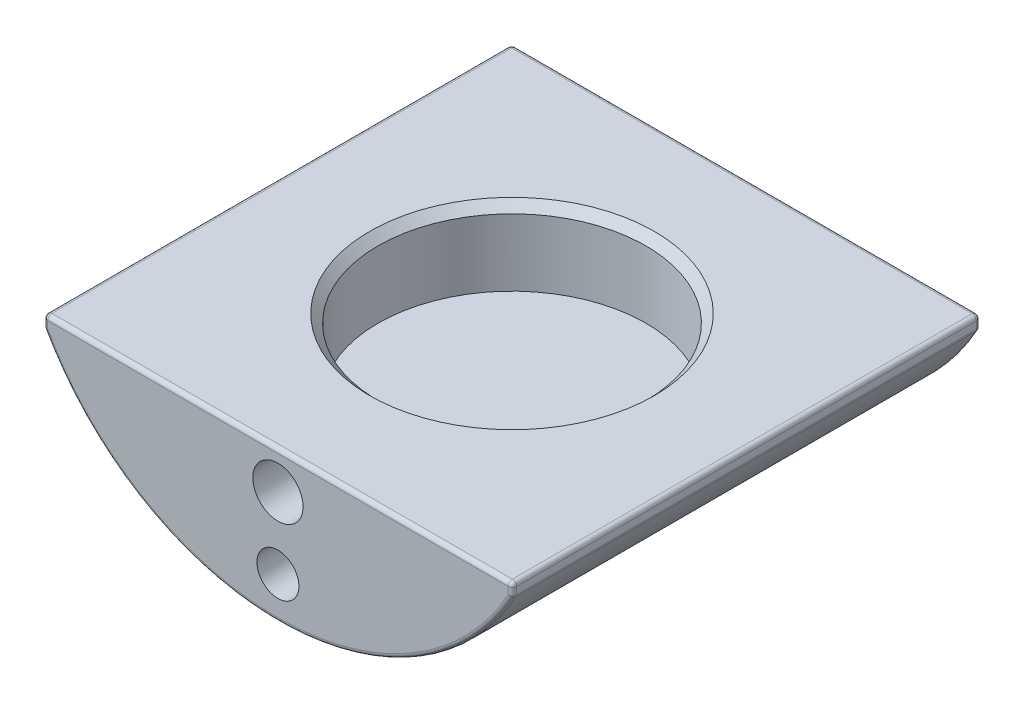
ISO-10303-21;
HEADER;
FILE_DESCRIPTION(('STEP AP214'),'2;1');
FILE_NAME('part.step','',(''),(''),'','','');
FILE_SCHEMA(('AUTOMOTIVE_DESIGN { 1 0 10303 214 1 1 1 1 }'));
ENDSEC;
DATA;
#1=APPLICATION_CONTEXT('core data for automotive mechanical design processes');
#2=APPLICATION_PROTOCOL_DEFINITION('international standard','automotive_design',2000,#1);
#3=PRODUCT_CONTEXT('',#1,'mechanical');
#4=PRODUCT('Part','Part','',(#3));
#5=PRODUCT_RELATED_PRODUCT_CATEGORY('part','',(#4));
#6=PRODUCT_DEFINITION_FORMATION('','',#4);
#7=PRODUCT_DEFINITION_CONTEXT('part definition',#1,'design');
#8=PRODUCT_DEFINITION('design','',#6,#7);
#9=PRODUCT_DEFINITION_SHAPE('','',#8);
#10=(LENGTH_UNIT() NAMED_UNIT(*) SI_UNIT(.MILLI.,.METRE.));
#11=(NAMED_UNIT(*) PLANE_ANGLE_UNIT() SI_UNIT($,.RADIAN.));
#12=(NAMED_UNIT(*) SI_UNIT($,.STERADIAN.) SOLID_ANGLE_UNIT());
#13=UNCERTAINTY_MEASURE_WITH_UNIT(LENGTH_MEASURE(1.E-05),#10,'distance_accuracy_value','');
#14=(GEOMETRIC_REPRESENTATION_CONTEXT(3) GLOBAL_UNCERTAINTY_ASSIGNED_CONTEXT((#13)) GLOBAL_UNIT_ASSIGNED_CONTEXT((#10,
#11,#12)) REPRESENTATION_CONTEXT('',''));
#15=CARTESIAN_POINT('',(0.,0.,0.));
#16=DIRECTION('',(0.,0.,1.));
#17=DIRECTION('',(1.,0.,0.));
#18=AXIS2_PLACEMENT_3D('',#15,#16,#17);
#19=CARTESIAN_POINT('',(0.,22.225,-44.3865));
#20=DIRECTION('',(0.,0.,1.));
#21=DIRECTION('',(1.,0.,0.));
#22=AXIS2_PLACEMENT_3D('',#19,#20,#21);
#23=PLANE('',#22);
#24=DIRECTION('',(0.,-1.,0.));
#25=VECTOR('',#24,1.);
#26=CARTESIAN_POINT('',(-43.65625,-0.79375,-44.3865));
#27=LINE('',#26,#25);
#28=CARTESIAN_POINT('',(-43.65625,-2.16263774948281,-44.3865));
#29=VERTEX_POINT('',#28);
#30=CARTESIAN_POINT('',(-43.65625,-0.79375,-44.3865));
#31=VERTEX_POINT('',#30);
#32=EDGE_CURVE('E197',#29,#31,#27,.F.);
#33=ORIENTED_EDGE('',*,*,#32,.T.);
#34=DIRECTION('',(1.,0.,0.));
#35=VECTOR('',#34,1.);
#36=CARTESIAN_POINT('',(0.,-0.793750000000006,-44.3865));
#37=LINE('',#36,#35);
#38=CARTESIAN_POINT('',(43.65625,-0.793750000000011,-44.3865));
#39=VERTEX_POINT('',#38);
#40=EDGE_CURVE('E199',#31,#39,#37,.T.);
#41=ORIENTED_EDGE('',*,*,#40,.T.);
#42=DIRECTION('',(0.,1.,0.));
#43=VECTOR('',#42,1.);
#44=CARTESIAN_POINT('',(43.65625,-2.16263774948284,-44.3865));
#45=LINE('',#44,#43);
#46=CARTESIAN_POINT('',(43.65625,-2.16263774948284,-44.3865));
#47=VERTEX_POINT('',#46);
#48=EDGE_CURVE('E195',#39,#47,#45,.F.);
#49=ORIENTED_EDGE('',*,*,#48,.T.);
#50=CARTESIAN_POINT('',(0.,22.225,-44.3865));
#51=DIRECTION('',(0.,0.,1.));
#52=DIRECTION('',(1.,0.,0.));
#53=AXIS2_PLACEMENT_3D('',#50,#51,#52);
#54=CIRCLE('',#53,50.00625);
#55=EDGE_CURVE('E193',#47,#29,#54,.F.);
#56=ORIENTED_EDGE('',*,*,#55,.T.);
#57=EDGE_LOOP('',(#33,#41,#49,#56));
#58=FACE_BOUND('',#57,.T.);
#59=CARTESIAN_POINT('',(0.,-7.14375,-44.3865));
#60=DIRECTION('',(0.,0.,1.));
#61=DIRECTION('',(1.,0.,0.));
#62=AXIS2_PLACEMENT_3D('',#59,#60,#61);
#63=CIRCLE('',#62,4.7625);
#64=CARTESIAN_POINT('',(4.7625,-7.14375,-44.3865));
#65=VERTEX_POINT('',#64);
#66=EDGE_CURVE('E300',#65,#65,#63,.T.);
#67=ORIENTED_EDGE('',*,*,#66,.T.);
#68=EDGE_LOOP('',(#67));
#69=FACE_BOUND('',#68,.T.);
#70=CARTESIAN_POINT('',(0.,-20.6248,-44.3865000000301));
#71=DIRECTION('',(0.,0.,1.));
#72=DIRECTION('',(1.,0.,0.));
#73=AXIS2_PLACEMENT_3D('',#70,#71,#72);
#74=CIRCLE('',#73,3.9751);
#75=CARTESIAN_POINT('',(3.9751,-20.6248,-44.3865000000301));
#76=VERTEX_POINT('',#75);
#77=EDGE_CURVE('E294',#76,#76,#74,.T.);
#78=ORIENTED_EDGE('',*,*,#77,.T.);
#79=EDGE_LOOP('',(#78));
#80=FACE_BOUND('',#79,.T.);
#81=ADVANCED_FACE('F31',(#58,#69,#80),#23,.F.);
#82=CARTESIAN_POINT('',(-44.45,0.,-44.3865));
#83=DIRECTION('',(-1.,0.,0.));
#84=DIRECTION('',(0.,-1.,0.));
#85=AXIS2_PLACEMENT_3D('',#82,#83,#84);
#86=PLANE('',#85);
#87=DIRECTION('',(0.,0.,1.));
#88=VECTOR('',#87,1.);
#89=CARTESIAN_POINT('',(-44.45,-0.793749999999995,-44.3865));
#90=LINE('',#89,#88);
#91=CARTESIAN_POINT('',(-44.45,-0.793749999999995,43.59275));
#92=VERTEX_POINT('',#91);
#93=CARTESIAN_POINT('',(-44.45,-0.793749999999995,-43.59275));
#94=VERTEX_POINT('',#93);
#95=EDGE_CURVE('E171',#92,#94,#90,.F.);
#96=ORIENTED_EDGE('',*,*,#95,.T.);
#97=DIRECTION('',(0.,-1.,0.));
#98=VECTOR('',#97,1.);
#99=CARTESIAN_POINT('',(-44.45,-2.16263774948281,-43.59275));
#100=LINE('',#99,#98);
#101=CARTESIAN_POINT('',(-44.45,-2.16263774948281,-43.59275));
#102=VERTEX_POINT('',#101);
#103=EDGE_CURVE('E207',#94,#102,#100,.T.);
#104=ORIENTED_EDGE('',*,*,#103,.T.);
#105=DIRECTION('',(0.,0.,1.));
#106=VECTOR('',#105,1.);
#107=CARTESIAN_POINT('',(-44.45,-2.16263774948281,-44.3865));
#108=LINE('',#107,#106);
#109=CARTESIAN_POINT('',(-44.45,-2.16263774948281,43.59275));
#110=VERTEX_POINT('',#109);
#111=EDGE_CURVE('E157',#102,#110,#108,.T.);
#112=ORIENTED_EDGE('',*,*,#111,.T.);
#113=DIRECTION('',(0.,-1.,0.));
#114=VECTOR('',#113,1.);
#115=CARTESIAN_POINT('',(-44.45,0.,43.59275));
#116=LINE('',#115,#114);
#117=EDGE_CURVE('E144',#110,#92,#116,.F.);
#118=ORIENTED_EDGE('',*,*,#117,.T.);
#119=EDGE_LOOP('',(#96,#104,#112,#118));
#120=FACE_BOUND('',#119,.T.);
#121=ADVANCED_FACE('F33',(#120),#86,.T.);
#122=CARTESIAN_POINT('',(-44.45,0.,-44.3865));
#123=DIRECTION('',(0.,-1.,0.));
#124=DIRECTION('',(1.,0.,0.));
#125=AXIS2_PLACEMENT_3D('',#122,#123,#124);
#126=PLANE('',#125);
#127=CARTESIAN_POINT('',(0.,0.,0.));
#128=DIRECTION('',(0.,-1.,0.));
#129=DIRECTION('',(1.,0.,0.));
#130=AXIS2_PLACEMENT_3D('',#127,#128,#129);
#131=CIRCLE('',#130,26.9875);
#132=CARTESIAN_POINT('',(26.9875,0.,0.));
#133=VERTEX_POINT('',#132);
#134=EDGE_CURVE('E11',#133,#133,#131,.T.);
#135=ORIENTED_EDGE('',*,*,#134,.T.);
#136=EDGE_LOOP('',(#135));
#137=FACE_BOUND('',#136,.T.);
#138=DIRECTION('',(0.,0.,1.));
#139=VECTOR('',#138,1.);
#140=CARTESIAN_POINT('',(43.65625,0.,-44.3865));
#141=LINE('',#140,#139);
#142=CARTESIAN_POINT('',(43.65625,0.,43.59275));
#143=VERTEX_POINT('',#142);
#144=CARTESIAN_POINT('',(43.65625,0.,-43.59275));
#145=VERTEX_POINT('',#144);
#146=EDGE_CURVE('E151',#143,#145,#141,.F.);
#147=ORIENTED_EDGE('',*,*,#146,.T.);
#148=DIRECTION('',(1.,0.,0.));
#149=VECTOR('',#148,1.);
#150=CARTESIAN_POINT('',(-44.45,0.,-43.59275));
#151=LINE('',#150,#149);
#152=CARTESIAN_POINT('',(-43.65625,0.,-43.59275));
#153=VERTEX_POINT('',#152);
#154=EDGE_CURVE('E202',#145,#153,#151,.F.);
#155=ORIENTED_EDGE('',*,*,#154,.T.);
#156=DIRECTION('',(0.,0.,1.));
#157=VECTOR('',#156,1.);
#158=CARTESIAN_POINT('',(-43.65625,0.,44.3865));
#159=LINE('',#158,#157);
#160=CARTESIAN_POINT('',(-43.65625,0.,43.59275));
#161=VERTEX_POINT('',#160);
#162=EDGE_CURVE('E154',#153,#161,#159,.T.);
#163=ORIENTED_EDGE('',*,*,#162,.T.);
#164=DIRECTION('',(1.,0.,0.));
#165=VECTOR('',#164,1.);
#166=CARTESIAN_POINT('',(43.65625,0.,43.59275));
#167=LINE('',#166,#165);
#168=EDGE_CURVE('E127',#161,#143,#167,.T.);
#169=ORIENTED_EDGE('',*,*,#168,.T.);
#170=EDGE_LOOP('',(#147,#155,#163,#169));
#171=FACE_BOUND('',#170,.T.);
#172=ADVANCED_FACE('F149',(#137,#171),#126,.F.);
#173=CARTESIAN_POINT('',(44.45,-2.3684442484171,-44.3865));
#174=DIRECTION('',(1.,0.,0.));
#175=DIRECTION('',(0.,1.,0.));
#176=AXIS2_PLACEMENT_3D('',#173,#174,#175);
#177=PLANE('',#176);
#178=DIRECTION('',(0.,0.,1.));
#179=VECTOR('',#178,1.);
#180=CARTESIAN_POINT('',(44.45,-2.16263774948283,-44.3865));
#181=LINE('',#180,#179);
#182=CARTESIAN_POINT('',(44.45,-2.16263774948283,43.59275));
#183=VERTEX_POINT('',#182);
#184=CARTESIAN_POINT('',(44.45,-2.16263774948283,-43.59275));
#185=VERTEX_POINT('',#184);
#186=EDGE_CURVE('E321',#183,#185,#181,.F.);
#187=ORIENTED_EDGE('',*,*,#186,.T.);
#188=DIRECTION('',(0.,1.,0.));
#189=VECTOR('',#188,1.);
#190=CARTESIAN_POINT('',(44.45,-0.793750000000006,-43.59275));
#191=LINE('',#190,#189);
#192=CARTESIAN_POINT('',(44.45,-0.793750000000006,-43.59275));
#193=VERTEX_POINT('',#192);
#194=EDGE_CURVE('E209',#185,#193,#191,.T.);
#195=ORIENTED_EDGE('',*,*,#194,.T.);
#196=DIRECTION('',(0.,0.,1.));
#197=VECTOR('',#196,1.);
#198=CARTESIAN_POINT('',(44.45,-0.793750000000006,44.3865));
#199=LINE('',#198,#197);
#200=CARTESIAN_POINT('',(44.45,-0.793750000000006,43.59275));
#201=VERTEX_POINT('',#200);
#202=EDGE_CURVE('E166',#193,#201,#199,.T.);
#203=ORIENTED_EDGE('',*,*,#202,.T.);
#204=DIRECTION('',(0.,1.,0.));
#205=VECTOR('',#204,1.);
#206=CARTESIAN_POINT('',(44.45,-2.3684442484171,43.59275));
#207=LINE('',#206,#205);
#208=EDGE_CURVE('E183',#201,#183,#207,.F.);
#209=ORIENTED_EDGE('',*,*,#208,.T.);
#210=EDGE_LOOP('',(#187,#195,#203,#209));
#211=FACE_BOUND('',#210,.T.);
#212=ADVANCED_FACE('F246',(#211),#177,.T.);
#213=CARTESIAN_POINT('',(0.,22.225,-44.3865));
#214=DIRECTION('',(0.,0.,1.));
#215=DIRECTION('',(1.,0.,0.));
#216=AXIS2_PLACEMENT_3D('',#213,#214,#215);
#217=CYLINDRICAL_SURFACE('',#216,50.8);
#218=DIRECTION('',(0.,0.,1.));
#219=VECTOR('',#218,1.);
#220=CARTESIAN_POINT('',(-44.3492063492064,-2.54974311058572,-44.3865));
#221=LINE('',#220,#219);
#222=CARTESIAN_POINT('',(-44.3492063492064,-2.54974311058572,43.59275));
#223=VERTEX_POINT('',#222);
#224=CARTESIAN_POINT('',(-44.3492063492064,-2.54974311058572,-43.59275));
#225=VERTEX_POINT('',#224);
#226=EDGE_CURVE('E162',#223,#225,#221,.F.);
#227=ORIENTED_EDGE('',*,*,#226,.T.);
#228=CARTESIAN_POINT('',(0.,22.225,-43.59275));
#229=DIRECTION('',(0.,0.,1.));
#230=DIRECTION('',(1.,0.,0.));
#231=AXIS2_PLACEMENT_3D('',#228,#229,#230);
#232=CIRCLE('',#231,50.8);
#233=CARTESIAN_POINT('',(44.3492063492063,-2.54974311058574,-43.59275));
#234=VERTEX_POINT('',#233);
#235=EDGE_CURVE('E46',#225,#234,#232,.T.);
#236=ORIENTED_EDGE('',*,*,#235,.T.);
#237=DIRECTION('',(0.,0.,1.));
#238=VECTOR('',#237,1.);
#239=CARTESIAN_POINT('',(44.3492063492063,-2.54974311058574,-44.3865));
#240=LINE('',#239,#238);
#241=CARTESIAN_POINT('',(44.3492063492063,-2.54974311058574,43.59275));
#242=VERTEX_POINT('',#241);
#243=EDGE_CURVE('E164',#234,#242,#240,.T.);
#244=ORIENTED_EDGE('',*,*,#243,.T.);
#245=CARTESIAN_POINT('',(0.,22.225,43.59275));
#246=DIRECTION('',(0.,0.,1.));
#247=DIRECTION('',(1.,0.,0.));
#248=AXIS2_PLACEMENT_3D('',#245,#246,#247);
#249=CIRCLE('',#248,50.8);
#250=EDGE_CURVE('E191',#242,#223,#249,.F.);
#251=ORIENTED_EDGE('',*,*,#250,.T.);
#252=EDGE_LOOP('',(#227,#236,#244,#251));
#253=FACE_BOUND('',#252,.T.);
#254=ADVANCED_FACE('F249',(#253),#217,.T.);
#255=CARTESIAN_POINT('',(0.,22.225,44.3865));
#256=DIRECTION('',(0.,0.,1.));
#257=DIRECTION('',(1.,0.,0.));
#258=AXIS2_PLACEMENT_3D('',#255,#256,#257);
#259=PLANE('',#258);
#260=DIRECTION('',(0.,1.,0.));
#261=VECTOR('',#260,1.);
#262=CARTESIAN_POINT('',(43.6562499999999,22.2250000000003,44.3865));
#263=LINE('',#262,#261);
#264=CARTESIAN_POINT('',(43.65625,-2.16263774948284,44.3865));
#265=VERTEX_POINT('',#264);
#266=CARTESIAN_POINT('',(43.65625,-0.793750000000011,44.3865));
#267=VERTEX_POINT('',#266);
#268=EDGE_CURVE('E176',#265,#267,#263,.T.);
#269=ORIENTED_EDGE('',*,*,#268,.T.);
#270=DIRECTION('',(1.,0.,0.));
#271=VECTOR('',#270,1.);
#272=CARTESIAN_POINT('',(-43.65625,-0.79375,44.3865));
#273=LINE('',#272,#271);
#274=CARTESIAN_POINT('',(-43.65625,-0.79375,44.3865));
#275=VERTEX_POINT('',#274);
#276=EDGE_CURVE('E129',#267,#275,#273,.F.);
#277=ORIENTED_EDGE('',*,*,#276,.T.);
#278=DIRECTION('',(0.,-1.,0.));
#279=VECTOR('',#278,1.);
#280=CARTESIAN_POINT('',(-43.6562499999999,22.2250000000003,44.3865));
#281=LINE('',#280,#279);
#282=CARTESIAN_POINT('',(-43.65625,-2.16263774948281,44.3865));
#283=VERTEX_POINT('',#282);
#284=EDGE_CURVE('E178',#275,#283,#281,.T.);
#285=ORIENTED_EDGE('',*,*,#284,.T.);
#286=CARTESIAN_POINT('',(0.,22.225,44.3865));
#287=DIRECTION('',(0.,0.,1.));
#288=DIRECTION('',(1.,0.,0.));
#289=AXIS2_PLACEMENT_3D('',#286,#287,#288);
#290=CIRCLE('',#289,50.00625);
#291=EDGE_CURVE('E156',#283,#265,#290,.T.);
#292=ORIENTED_EDGE('',*,*,#291,.T.);
#293=EDGE_LOOP('',(#269,#277,#285,#292));
#294=FACE_BOUND('',#293,.T.);
#295=CARTESIAN_POINT('',(0.,-20.6248,44.3865000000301));
#296=DIRECTION('',(0.,0.,1.));
#297=DIRECTION('',(1.,0.,0.));
#298=AXIS2_PLACEMENT_3D('',#295,#296,#297);
#299=CIRCLE('',#298,3.9751);
#300=CARTESIAN_POINT('',(3.9751,-20.6248,44.3865000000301));
#301=VERTEX_POINT('',#300);
#302=EDGE_CURVE('E306',#301,#301,#299,.T.);
#303=ORIENTED_EDGE('',*,*,#302,.F.);
#304=EDGE_LOOP('',(#303));
#305=FACE_BOUND('',#304,.T.);
#306=CARTESIAN_POINT('',(0.,-7.14375,44.3865));
#307=DIRECTION('',(0.,0.,1.));
#308=DIRECTION('',(1.,0.,0.));
#309=AXIS2_PLACEMENT_3D('',#306,#307,#308);
#310=CIRCLE('',#309,4.7625);
#311=CARTESIAN_POINT('',(4.7625,-7.14375,44.3865));
#312=VERTEX_POINT('',#311);
#313=EDGE_CURVE('E312',#312,#312,#310,.T.);
#314=ORIENTED_EDGE('',*,*,#313,.F.);
#315=EDGE_LOOP('',(#314));
#316=FACE_BOUND('',#315,.T.);
#317=ADVANCED_FACE('F242',(#294,#305,#316),#259,.T.);
#318=CARTESIAN_POINT('',(0.,-14.2875,0.));
#319=DIRECTION('',(0.,1.,0.));
#320=DIRECTION('',(-1.,0.,0.));
#321=AXIS2_PLACEMENT_3D('',#318,#319,#320);
#322=CYLINDRICAL_SURFACE('',#321,25.4);
#323=CARTESIAN_POINT('',(0.,-1.5875,0.));
#324=DIRECTION('',(0.,-1.,0.));
#325=DIRECTION('',(1.,0.,0.));
#326=AXIS2_PLACEMENT_3D('',#323,#324,#325);
#327=CIRCLE('',#326,25.4);
#328=CARTESIAN_POINT('',(25.4,-1.58750000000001,0.));
#329=VERTEX_POINT('',#328);
#330=EDGE_CURVE('E39',#329,#329,#327,.F.);
#331=ORIENTED_EDGE('',*,*,#330,.T.);
#332=EDGE_LOOP('',(#331));
#333=FACE_BOUND('',#332,.T.);
#334=CARTESIAN_POINT('',(0.,-14.2875,0.));
#335=DIRECTION('',(0.,1.,0.));
#336=DIRECTION('',(-1.,0.,0.));
#337=AXIS2_PLACEMENT_3D('',#334,#335,#336);
#338=CIRCLE('',#337,25.4);
#339=CARTESIAN_POINT('',(-25.4,-14.2875,0.));
#340=VERTEX_POINT('',#339);
#341=EDGE_CURVE('E318',#340,#340,#338,.T.);
#342=ORIENTED_EDGE('',*,*,#341,.F.);
#343=EDGE_LOOP('',(#342));
#344=FACE_BOUND('',#343,.T.);
#345=ADVANCED_FACE('F217',(#333,#344),#322,.F.);
#346=CARTESIAN_POINT('',(0.,-14.2875,0.));
#347=DIRECTION('',(0.,1.,0.));
#348=DIRECTION('',(-1.,0.,0.));
#349=AXIS2_PLACEMENT_3D('',#346,#347,#348);
#350=PLANE('',#349);
#351=ORIENTED_EDGE('',*,*,#341,.T.);
#352=EDGE_LOOP('',(#351));
#353=FACE_BOUND('',#352,.T.);
#354=ADVANCED_FACE('F459',(#353),#350,.T.);
#355=CARTESIAN_POINT('',(0.,-7.14375,30.099));
#356=DIRECTION('',(0.,0.,1.));
#357=DIRECTION('',(1.,0.,0.));
#358=AXIS2_PLACEMENT_3D('',#355,#356,#357);
#359=CYLINDRICAL_SURFACE('',#358,4.7625);
#360=CARTESIAN_POINT('',(0.,-7.14375,30.099));
#361=DIRECTION('',(0.,0.,1.));
#362=DIRECTION('',(1.,0.,0.));
#363=AXIS2_PLACEMENT_3D('',#360,#361,#362);
#364=CIRCLE('',#363,4.7625);
#365=CARTESIAN_POINT('',(4.7625,-7.14375,30.099));
#366=VERTEX_POINT('',#365);
#367=EDGE_CURVE('E315',#366,#366,#364,.T.);
#368=ORIENTED_EDGE('',*,*,#367,.F.);
#369=EDGE_LOOP('',(#368));
#370=FACE_BOUND('',#369,.T.);
#371=ORIENTED_EDGE('',*,*,#313,.T.);
#372=EDGE_LOOP('',(#371));
#373=FACE_BOUND('',#372,.T.);
#374=ADVANCED_FACE('F455',(#370,#373),#359,.F.);
#375=CARTESIAN_POINT('',(0.,-7.14375,30.099));
#376=DIRECTION('',(0.,0.,1.));
#377=DIRECTION('',(1.,0.,0.));
#378=AXIS2_PLACEMENT_3D('',#375,#376,#377);
#379=PLANE('',#378);
#380=ORIENTED_EDGE('',*,*,#367,.T.);
#381=EDGE_LOOP('',(#380));
#382=FACE_BOUND('',#381,.T.);
#383=ADVANCED_FACE('F451',(#382),#379,.T.);
#384=CARTESIAN_POINT('',(0.,-20.6248,26.9240000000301));
#385=DIRECTION('',(0.,0.,1.));
#386=DIRECTION('',(1.,0.,0.));
#387=AXIS2_PLACEMENT_3D('',#384,#385,#386);
#388=CYLINDRICAL_SURFACE('',#387,3.9751);
#389=CARTESIAN_POINT('',(0.,-20.6248,26.9240000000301));
#390=DIRECTION('',(0.,0.,1.));
#391=DIRECTION('',(1.,0.,0.));
#392=AXIS2_PLACEMENT_3D('',#389,#390,#391);
#393=CIRCLE('',#392,3.9751);
#394=CARTESIAN_POINT('',(3.9751,-20.6248,26.9240000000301));
#395=VERTEX_POINT('',#394);
#396=EDGE_CURVE('E309',#395,#395,#393,.T.);
#397=ORIENTED_EDGE('',*,*,#396,.F.);
#398=EDGE_LOOP('',(#397));
#399=FACE_BOUND('',#398,.T.);
#400=ORIENTED_EDGE('',*,*,#302,.T.);
#401=EDGE_LOOP('',(#400));
#402=FACE_BOUND('',#401,.T.);
#403=ADVANCED_FACE('F447',(#399,#402),#388,.F.);
#404=CARTESIAN_POINT('',(0.,-20.6248,26.9240000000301));
#405=DIRECTION('',(0.,0.,1.));
#406=DIRECTION('',(1.,0.,0.));
#407=AXIS2_PLACEMENT_3D('',#404,#405,#406);
#408=PLANE('',#407);
#409=ORIENTED_EDGE('',*,*,#396,.T.);
#410=EDGE_LOOP('',(#409));
#411=FACE_BOUND('',#410,.T.);
#412=ADVANCED_FACE('F443',(#411),#408,.T.);
#413=CARTESIAN_POINT('',(0.,-7.14375,-30.099));
#414=DIRECTION('',(0.,0.,-1.));
#415=DIRECTION('',(-1.,0.,0.));
#416=AXIS2_PLACEMENT_3D('',#413,#414,#415);
#417=CYLINDRICAL_SURFACE('',#416,4.7625);
#418=CARTESIAN_POINT('',(0.,-7.14375,-30.099));
#419=DIRECTION('',(0.,0.,1.));
#420=DIRECTION('',(1.,0.,0.));
#421=AXIS2_PLACEMENT_3D('',#418,#419,#420);
#422=CIRCLE('',#421,4.7625);
#423=CARTESIAN_POINT('',(4.7625,-7.14375,-30.099));
#424=VERTEX_POINT('',#423);
#425=EDGE_CURVE('E303',#424,#424,#422,.T.);
#426=ORIENTED_EDGE('',*,*,#425,.T.);
#427=EDGE_LOOP('',(#426));
#428=FACE_BOUND('',#427,.T.);
#429=ORIENTED_EDGE('',*,*,#66,.F.);
#430=EDGE_LOOP('',(#429));
#431=FACE_BOUND('',#430,.T.);
#432=ADVANCED_FACE('F439',(#428,#431),#417,.F.);
#433=CARTESIAN_POINT('',(0.,-7.14375,-30.099));
#434=DIRECTION('',(0.,0.,-1.));
#435=DIRECTION('',(1.,0.,0.));
#436=AXIS2_PLACEMENT_3D('',#433,#434,#435);
#437=PLANE('',#436);
#438=ORIENTED_EDGE('',*,*,#425,.F.);
#439=EDGE_LOOP('',(#438));
#440=FACE_BOUND('',#439,.T.);
#441=ADVANCED_FACE('F435',(#440),#437,.T.);
#442=CARTESIAN_POINT('',(0.,-20.6248,-26.9240000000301));
#443=DIRECTION('',(0.,0.,-1.));
#444=DIRECTION('',(-1.,0.,0.));
#445=AXIS2_PLACEMENT_3D('',#442,#443,#444);
#446=CYLINDRICAL_SURFACE('',#445,3.9751);
#447=CARTESIAN_POINT('',(0.,-20.6248,-26.9240000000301));
#448=DIRECTION('',(0.,0.,1.));
#449=DIRECTION('',(1.,0.,0.));
#450=AXIS2_PLACEMENT_3D('',#447,#448,#449);
#451=CIRCLE('',#450,3.9751);
#452=CARTESIAN_POINT('',(3.9751,-20.6248,-26.9240000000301));
#453=VERTEX_POINT('',#452);
#454=EDGE_CURVE('E297',#453,#453,#451,.T.);
#455=ORIENTED_EDGE('',*,*,#454,.T.);
#456=EDGE_LOOP('',(#455));
#457=FACE_BOUND('',#456,.T.);
#458=ORIENTED_EDGE('',*,*,#77,.F.);
#459=EDGE_LOOP('',(#458));
#460=FACE_BOUND('',#459,.T.);
#461=ADVANCED_FACE('F431',(#457,#460),#446,.F.);
#462=CARTESIAN_POINT('',(0.,-20.6248,-26.9240000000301));
#463=DIRECTION('',(0.,0.,-1.));
#464=DIRECTION('',(1.,0.,0.));
#465=AXIS2_PLACEMENT_3D('',#462,#463,#464);
#466=PLANE('',#465);
#467=ORIENTED_EDGE('',*,*,#454,.F.);
#468=EDGE_LOOP('',(#467));
#469=FACE_BOUND('',#468,.T.);
#470=ADVANCED_FACE('F428',(#469),#466,.T.);
#471=CARTESIAN_POINT('',(43.65625,-0.793750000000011,-44.3865));
#472=DIRECTION('',(0.,0.,-1.));
#473=DIRECTION('',(-1.,0.,0.));
#474=AXIS2_PLACEMENT_3D('',#471,#472,#473);
#475=CYLINDRICAL_SURFACE('',#474,0.79375);
#476=ORIENTED_EDGE('',*,*,#202,.F.);
#477=CARTESIAN_POINT('',(43.65625,-0.793750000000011,-43.59275));
#478=DIRECTION('',(0.,0.,-1.));
#479=DIRECTION('',(-1.,0.,0.));
#480=AXIS2_PLACEMENT_3D('',#477,#478,#479);
#481=CIRCLE('',#480,0.79375);
#482=EDGE_CURVE('E161',#193,#145,#481,.F.);
#483=ORIENTED_EDGE('',*,*,#482,.T.);
#484=ORIENTED_EDGE('',*,*,#146,.F.);
#485=CARTESIAN_POINT('',(43.65625,-0.793750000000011,43.59275));
#486=DIRECTION('',(0.,0.,-1.));
#487=DIRECTION('',(-1.,0.,0.));
#488=AXIS2_PLACEMENT_3D('',#485,#486,#487);
#489=CIRCLE('',#488,0.79375);
#490=EDGE_CURVE('E136',#143,#201,#489,.T.);
#491=ORIENTED_EDGE('',*,*,#490,.T.);
#492=EDGE_LOOP('',(#476,#483,#484,#491));
#493=FACE_BOUND('',#492,.T.);
#494=ADVANCED_FACE('F159',(#493),#475,.T.);
#495=CARTESIAN_POINT('',(43.65625,-2.16263774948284,-44.3865));
#496=DIRECTION('',(0.,0.,1.));
#497=DIRECTION('',(1.,0.,0.));
#498=AXIS2_PLACEMENT_3D('',#495,#496,#497);
#499=CYLINDRICAL_SURFACE('',#498,0.79375);
#500=ORIENTED_EDGE('',*,*,#243,.F.);
#501=CARTESIAN_POINT('',(43.65625,-2.16263774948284,-43.59275));
#502=DIRECTION('',(0.,0.,1.));
#503=DIRECTION('',(1.,0.,0.));
#504=AXIS2_PLACEMENT_3D('',#501,#502,#503);
#505=CIRCLE('',#504,0.79375);
#506=EDGE_CURVE('E212',#234,#185,#505,.T.);
#507=ORIENTED_EDGE('',*,*,#506,.T.);
#508=ORIENTED_EDGE('',*,*,#186,.F.);
#509=CARTESIAN_POINT('',(43.65625,-2.16263774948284,43.59275));
#510=DIRECTION('',(0.,0.,1.));
#511=DIRECTION('',(1.,0.,0.));
#512=AXIS2_PLACEMENT_3D('',#509,#510,#511);
#513=CIRCLE('',#512,0.79375);
#514=EDGE_CURVE('E188',#183,#242,#513,.F.);
#515=ORIENTED_EDGE('',*,*,#514,.T.);
#516=EDGE_LOOP('',(#500,#507,#508,#515));
#517=FACE_BOUND('',#516,.T.);
#518=ADVANCED_FACE('F354',(#517),#499,.T.);
#519=CARTESIAN_POINT('',(-43.65625,-2.16263774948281,-44.3865));
#520=DIRECTION('',(0.,0.,1.));
#521=DIRECTION('',(1.,0.,0.));
#522=AXIS2_PLACEMENT_3D('',#519,#520,#521);
#523=CYLINDRICAL_SURFACE('',#522,0.79375);
#524=ORIENTED_EDGE('',*,*,#111,.F.);
#525=CARTESIAN_POINT('',(-43.65625,-2.16263774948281,-43.59275));
#526=DIRECTION('',(0.,0.,1.));
#527=DIRECTION('',(1.,0.,0.));
#528=AXIS2_PLACEMENT_3D('',#525,#526,#527);
#529=CIRCLE('',#528,0.79375);
#530=EDGE_CURVE('E54',#102,#225,#529,.T.);
#531=ORIENTED_EDGE('',*,*,#530,.T.);
#532=ORIENTED_EDGE('',*,*,#226,.F.);
#533=CARTESIAN_POINT('',(-43.65625,-2.16263774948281,43.59275));
#534=DIRECTION('',(0.,0.,1.));
#535=DIRECTION('',(1.,0.,0.));
#536=AXIS2_PLACEMENT_3D('',#533,#534,#535);
#537=CIRCLE('',#536,0.79375);
#538=EDGE_CURVE('E185',#223,#110,#537,.F.);
#539=ORIENTED_EDGE('',*,*,#538,.T.);
#540=EDGE_LOOP('',(#524,#531,#532,#539));
#541=FACE_BOUND('',#540,.T.);
#542=ADVANCED_FACE('F421',(#541),#523,.T.);
#543=CARTESIAN_POINT('',(-43.65625,-0.79375,-44.3865));
#544=DIRECTION('',(0.,0.,-1.));
#545=DIRECTION('',(-1.,0.,0.));
#546=AXIS2_PLACEMENT_3D('',#543,#544,#545);
#547=CYLINDRICAL_SURFACE('',#546,0.79375);
#548=ORIENTED_EDGE('',*,*,#162,.F.);
#549=CARTESIAN_POINT('',(-43.65625,-0.79375,-43.59275));
#550=DIRECTION('',(0.,0.,-1.));
#551=DIRECTION('',(-1.,0.,0.));
#552=AXIS2_PLACEMENT_3D('',#549,#550,#551);
#553=CIRCLE('',#552,0.79375);
#554=EDGE_CURVE('E204',#153,#94,#553,.F.);
#555=ORIENTED_EDGE('',*,*,#554,.T.);
#556=ORIENTED_EDGE('',*,*,#95,.F.);
#557=CARTESIAN_POINT('',(-43.65625,-0.79375,43.59275));
#558=DIRECTION('',(0.,0.,-1.));
#559=DIRECTION('',(-1.,0.,0.));
#560=AXIS2_PLACEMENT_3D('',#557,#558,#559);
#561=CIRCLE('',#560,0.79375);
#562=EDGE_CURVE('E145',#92,#161,#561,.T.);
#563=ORIENTED_EDGE('',*,*,#562,.T.);
#564=EDGE_LOOP('',(#548,#555,#556,#563));
#565=FACE_BOUND('',#564,.T.);
#566=ADVANCED_FACE('F379',(#565),#547,.T.);
#567=CARTESIAN_POINT('',(0.,22.225,43.59275));
#568=DIRECTION('',(0.,0.,1.));
#569=DIRECTION('',(1.,0.,0.));
#570=AXIS2_PLACEMENT_3D('',#567,#568,#569);
#571=TOROIDAL_SURFACE('',#570,50.00625,0.79375);
#572=CARTESIAN_POINT('',(-43.65625,-2.16263774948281,43.59275));
#573=DIRECTION('',(-0.487691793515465,0.873015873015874,0.));
#574=DIRECTION('',(-0.873015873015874,-0.487691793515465,0.));
#575=AXIS2_PLACEMENT_3D('',#572,#573,#574);
#576=CIRCLE('',#575,0.79375);
#577=EDGE_CURVE('E291',#223,#283,#576,.T.);
#578=ORIENTED_EDGE('',*,*,#577,.F.);
#579=ORIENTED_EDGE('',*,*,#250,.F.);
#580=CARTESIAN_POINT('',(43.65625,-2.16263774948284,43.59275));
#581=DIRECTION('',(0.487691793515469,0.873015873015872,0.));
#582=DIRECTION('',(-0.873015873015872,0.487691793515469,0.));
#583=AXIS2_PLACEMENT_3D('',#580,#581,#582);
#584=CIRCLE('',#583,0.79375);
#585=EDGE_CURVE('E288',#265,#242,#584,.T.);
#586=ORIENTED_EDGE('',*,*,#585,.F.);
#587=ORIENTED_EDGE('',*,*,#291,.F.);
#588=EDGE_LOOP('',(#578,#579,#586,#587));
#589=FACE_BOUND('',#588,.T.);
#590=ADVANCED_FACE('F360',(#589),#571,.T.);
#591=CARTESIAN_POINT('',(-43.65625,-2.16263774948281,43.59275));
#592=DIRECTION('',(0.,0.,1.));
#593=DIRECTION('',(1.,0.,0.));
#594=AXIS2_PLACEMENT_3D('',#591,#592,#593);
#595=SPHERICAL_SURFACE('',#594,0.79375);
#596=ORIENTED_EDGE('',*,*,#538,.F.);
#597=ORIENTED_EDGE('',*,*,#577,.T.);
#598=CARTESIAN_POINT('',(-43.65625,-2.16263774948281,43.59275));
#599=DIRECTION('',(0.,1.,0.));
#600=DIRECTION('',(-1.,0.,0.));
#601=AXIS2_PLACEMENT_3D('',#598,#599,#600);
#602=CIRCLE('',#601,0.79375);
#603=EDGE_CURVE('E285',#110,#283,#602,.T.);
#604=ORIENTED_EDGE('',*,*,#603,.F.);
#605=EDGE_LOOP('',(#596,#597,#604));
#606=FACE_BOUND('',#605,.T.);
#607=ADVANCED_FACE('F371',(#606),#595,.T.);
#608=CARTESIAN_POINT('',(43.65625,-2.16263774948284,43.59275));
#609=DIRECTION('',(0.,0.,1.));
#610=DIRECTION('',(1.,0.,0.));
#611=AXIS2_PLACEMENT_3D('',#608,#609,#610);
#612=SPHERICAL_SURFACE('',#611,0.79375);
#613=ORIENTED_EDGE('',*,*,#585,.T.);
#614=ORIENTED_EDGE('',*,*,#514,.F.);
#615=CARTESIAN_POINT('',(43.65625,-2.16263774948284,43.59275));
#616=DIRECTION('',(0.,1.,0.));
#617=DIRECTION('',(-1.,0.,0.));
#618=AXIS2_PLACEMENT_3D('',#615,#616,#617);
#619=CIRCLE('',#618,0.79375);
#620=EDGE_CURVE('E282',#265,#183,#619,.T.);
#621=ORIENTED_EDGE('',*,*,#620,.F.);
#622=EDGE_LOOP('',(#613,#614,#621));
#623=FACE_BOUND('',#622,.T.);
#624=ADVANCED_FACE('F363',(#623),#612,.T.);
#625=CARTESIAN_POINT('',(-43.6562499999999,22.2250000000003,43.59275));
#626=DIRECTION('',(0.,-1.,0.));
#627=DIRECTION('',(1.,0.,0.));
#628=AXIS2_PLACEMENT_3D('',#625,#626,#627);
#629=CYLINDRICAL_SURFACE('',#628,0.79375);
#630=ORIENTED_EDGE('',*,*,#603,.T.);
#631=ORIENTED_EDGE('',*,*,#284,.F.);
#632=CARTESIAN_POINT('',(-43.65625,-0.79375,43.59275));
#633=DIRECTION('',(0.,1.,0.));
#634=DIRECTION('',(-1.,0.,0.));
#635=AXIS2_PLACEMENT_3D('',#632,#633,#634);
#636=CIRCLE('',#635,0.79375);
#637=EDGE_CURVE('E279',#92,#275,#636,.T.);
#638=ORIENTED_EDGE('',*,*,#637,.F.);
#639=ORIENTED_EDGE('',*,*,#117,.F.);
#640=EDGE_LOOP('',(#630,#631,#638,#639));
#641=FACE_BOUND('',#640,.T.);
#642=ADVANCED_FACE('F374',(#641),#629,.T.);
#643=CARTESIAN_POINT('',(43.6562499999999,22.2250000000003,43.59275));
#644=DIRECTION('',(0.,1.,0.));
#645=DIRECTION('',(-1.,0.,0.));
#646=AXIS2_PLACEMENT_3D('',#643,#644,#645);
#647=CYLINDRICAL_SURFACE('',#646,0.79375);
#648=ORIENTED_EDGE('',*,*,#620,.T.);
#649=ORIENTED_EDGE('',*,*,#208,.F.);
#650=CARTESIAN_POINT('',(43.65625,-0.793750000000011,43.59275));
#651=DIRECTION('',(0.,1.,0.));
#652=DIRECTION('',(-1.,0.,0.));
#653=AXIS2_PLACEMENT_3D('',#650,#651,#652);
#654=CIRCLE('',#653,0.79375);
#655=EDGE_CURVE('E139',#267,#201,#654,.T.);
#656=ORIENTED_EDGE('',*,*,#655,.F.);
#657=ORIENTED_EDGE('',*,*,#268,.F.);
#658=EDGE_LOOP('',(#648,#649,#656,#657));
#659=FACE_BOUND('',#658,.T.);
#660=ADVANCED_FACE('F366',(#659),#647,.T.);
#661=CARTESIAN_POINT('',(-43.65625,-0.79375,43.59275));
#662=DIRECTION('',(0.,0.,1.));
#663=DIRECTION('',(1.,0.,0.));
#664=AXIS2_PLACEMENT_3D('',#661,#662,#663);
#665=SPHERICAL_SURFACE('',#664,0.79375);
#666=ORIENTED_EDGE('',*,*,#562,.F.);
#667=ORIENTED_EDGE('',*,*,#637,.T.);
#668=CARTESIAN_POINT('',(-43.65625,-0.79375,43.59275));
#669=DIRECTION('',(1.,0.,0.));
#670=DIRECTION('',(0.,0.,-1.));
#671=AXIS2_PLACEMENT_3D('',#668,#669,#670);
#672=CIRCLE('',#671,0.79375);
#673=EDGE_CURVE('E132',#161,#275,#672,.T.);
#674=ORIENTED_EDGE('',*,*,#673,.F.);
#675=EDGE_LOOP('',(#666,#667,#674));
#676=FACE_BOUND('',#675,.T.);
#677=ADVANCED_FACE('F405',(#676),#665,.T.);
#678=CARTESIAN_POINT('',(43.65625,-0.793750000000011,43.59275));
#679=DIRECTION('',(0.,0.,1.));
#680=DIRECTION('',(1.,0.,0.));
#681=AXIS2_PLACEMENT_3D('',#678,#679,#680);
#682=SPHERICAL_SURFACE('',#681,0.79375);
#683=ORIENTED_EDGE('',*,*,#655,.T.);
#684=ORIENTED_EDGE('',*,*,#490,.F.);
#685=CARTESIAN_POINT('',(43.65625,-0.793750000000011,43.59275));
#686=DIRECTION('',(-1.,0.,0.));
#687=DIRECTION('',(0.,0.,1.));
#688=AXIS2_PLACEMENT_3D('',#685,#686,#687);
#689=CIRCLE('',#688,0.79375);
#690=EDGE_CURVE('E123',#267,#143,#689,.T.);
#691=ORIENTED_EDGE('',*,*,#690,.F.);
#692=EDGE_LOOP('',(#683,#684,#691));
#693=FACE_BOUND('',#692,.T.);
#694=ADVANCED_FACE('F137',(#693),#682,.T.);
#695=CARTESIAN_POINT('',(-44.45,-0.79375,43.59275));
#696=DIRECTION('',(-1.,0.,0.));
#697=DIRECTION('',(0.,-1.,0.));
#698=AXIS2_PLACEMENT_3D('',#695,#696,#697);
#699=CYLINDRICAL_SURFACE('',#698,0.79375);
#700=ORIENTED_EDGE('',*,*,#673,.T.);
#701=ORIENTED_EDGE('',*,*,#276,.F.);
#702=ORIENTED_EDGE('',*,*,#690,.T.);
#703=ORIENTED_EDGE('',*,*,#168,.F.);
#704=EDGE_LOOP('',(#700,#701,#702,#703));
#705=FACE_BOUND('',#704,.T.);
#706=ADVANCED_FACE('F125',(#705),#699,.T.);
#707=CARTESIAN_POINT('',(0.,22.225,-43.59275));
#708=DIRECTION('',(0.,0.,1.));
#709=DIRECTION('',(1.,0.,0.));
#710=AXIS2_PLACEMENT_3D('',#707,#708,#709);
#711=TOROIDAL_SURFACE('',#710,50.00625,0.79375);
#712=CARTESIAN_POINT('',(43.65625,-2.16263774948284,-43.59275));
#713=DIRECTION('',(0.487691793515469,0.873015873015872,0.));
#714=DIRECTION('',(-0.873015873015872,0.487691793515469,0.));
#715=AXIS2_PLACEMENT_3D('',#712,#713,#714);
#716=CIRCLE('',#715,0.79375);
#717=EDGE_CURVE('E266',#234,#47,#716,.T.);
#718=ORIENTED_EDGE('',*,*,#717,.F.);
#719=ORIENTED_EDGE('',*,*,#235,.F.);
#720=CARTESIAN_POINT('',(-43.65625,-2.16263774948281,-43.59275));
#721=DIRECTION('',(-0.487691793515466,0.873015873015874,0.));
#722=DIRECTION('',(-0.873015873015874,-0.487691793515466,0.));
#723=AXIS2_PLACEMENT_3D('',#720,#721,#722);
#724=CIRCLE('',#723,0.79375);
#725=EDGE_CURVE('E133',#29,#225,#724,.T.);
#726=ORIENTED_EDGE('',*,*,#725,.F.);
#727=ORIENTED_EDGE('',*,*,#55,.F.);
#728=EDGE_LOOP('',(#718,#719,#726,#727));
#729=FACE_BOUND('',#728,.T.);
#730=ADVANCED_FACE('F262',(#729),#711,.T.);
#731=CARTESIAN_POINT('',(-43.65625,-2.16263774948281,-43.59275));
#732=DIRECTION('',(0.,0.,1.));
#733=DIRECTION('',(1.,0.,0.));
#734=AXIS2_PLACEMENT_3D('',#731,#732,#733);
#735=SPHERICAL_SURFACE('',#734,0.79375);
#736=ORIENTED_EDGE('',*,*,#725,.T.);
#737=ORIENTED_EDGE('',*,*,#530,.F.);
#738=CARTESIAN_POINT('',(-43.65625,-2.16263774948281,-43.59275));
#739=DIRECTION('',(0.,1.,0.));
#740=DIRECTION('',(-1.,0.,0.));
#741=AXIS2_PLACEMENT_3D('',#738,#739,#740);
#742=CIRCLE('',#741,0.79375);
#743=EDGE_CURVE('E271',#29,#102,#742,.T.);
#744=ORIENTED_EDGE('',*,*,#743,.F.);
#745=EDGE_LOOP('',(#736,#737,#744));
#746=FACE_BOUND('',#745,.T.);
#747=ADVANCED_FACE('F269',(#746),#735,.T.);
#748=CARTESIAN_POINT('',(43.65625,-2.16263774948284,-43.59275));
#749=DIRECTION('',(0.,0.,1.));
#750=DIRECTION('',(1.,0.,0.));
#751=AXIS2_PLACEMENT_3D('',#748,#749,#750);
#752=SPHERICAL_SURFACE('',#751,0.79375);
#753=ORIENTED_EDGE('',*,*,#506,.F.);
#754=ORIENTED_EDGE('',*,*,#717,.T.);
#755=CARTESIAN_POINT('',(43.65625,-2.16263774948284,-43.59275));
#756=DIRECTION('',(0.,1.,0.));
#757=DIRECTION('',(-1.,0.,0.));
#758=AXIS2_PLACEMENT_3D('',#755,#756,#757);
#759=CIRCLE('',#758,0.79375);
#760=EDGE_CURVE('E344',#185,#47,#759,.T.);
#761=ORIENTED_EDGE('',*,*,#760,.F.);
#762=EDGE_LOOP('',(#753,#754,#761));
#763=FACE_BOUND('',#762,.T.);
#764=ADVANCED_FACE('F352',(#763),#752,.T.);
#765=CARTESIAN_POINT('',(-43.65625,0.,-43.59275));
#766=DIRECTION('',(0.,1.,0.));
#767=DIRECTION('',(-1.,0.,0.));
#768=AXIS2_PLACEMENT_3D('',#765,#766,#767);
#769=CYLINDRICAL_SURFACE('',#768,0.79375);
#770=ORIENTED_EDGE('',*,*,#743,.T.);
#771=ORIENTED_EDGE('',*,*,#103,.F.);
#772=CARTESIAN_POINT('',(-43.65625,-0.79375,-43.59275));
#773=DIRECTION('',(0.,1.,0.));
#774=DIRECTION('',(-1.,0.,0.));
#775=AXIS2_PLACEMENT_3D('',#772,#773,#774);
#776=CIRCLE('',#775,0.79375);
#777=EDGE_CURVE('E334',#31,#94,#776,.T.);
#778=ORIENTED_EDGE('',*,*,#777,.F.);
#779=ORIENTED_EDGE('',*,*,#32,.F.);
#780=EDGE_LOOP('',(#770,#771,#778,#779));
#781=FACE_BOUND('',#780,.T.);
#782=ADVANCED_FACE('F347',(#781),#769,.T.);
#783=CARTESIAN_POINT('',(43.65625,-2.3684442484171,-43.59275));
#784=DIRECTION('',(0.,-1.,0.));
#785=DIRECTION('',(1.,0.,0.));
#786=AXIS2_PLACEMENT_3D('',#783,#784,#785);
#787=CYLINDRICAL_SURFACE('',#786,0.79375);
#788=ORIENTED_EDGE('',*,*,#760,.T.);
#789=ORIENTED_EDGE('',*,*,#48,.F.);
#790=CARTESIAN_POINT('',(43.65625,-0.793750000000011,-43.59275));
#791=DIRECTION('',(0.,1.,0.));
#792=DIRECTION('',(-1.,0.,0.));
#793=AXIS2_PLACEMENT_3D('',#790,#791,#792);
#794=CIRCLE('',#793,0.79375);
#795=EDGE_CURVE('E329',#193,#39,#794,.T.);
#796=ORIENTED_EDGE('',*,*,#795,.F.);
#797=ORIENTED_EDGE('',*,*,#194,.F.);
#798=EDGE_LOOP('',(#788,#789,#796,#797));
#799=FACE_BOUND('',#798,.T.);
#800=ADVANCED_FACE('F331',(#799),#787,.T.);
#801=CARTESIAN_POINT('',(-43.65625,-0.79375,-43.59275));
#802=DIRECTION('',(0.,0.,1.));
#803=DIRECTION('',(1.,0.,0.));
#804=AXIS2_PLACEMENT_3D('',#801,#802,#803);
#805=SPHERICAL_SURFACE('',#804,0.79375);
#806=ORIENTED_EDGE('',*,*,#777,.T.);
#807=ORIENTED_EDGE('',*,*,#554,.F.);
#808=CARTESIAN_POINT('',(-43.65625,-0.79375,-43.59275));
#809=DIRECTION('',(1.,0.,0.));
#810=DIRECTION('',(0.,0.,-1.));
#811=AXIS2_PLACEMENT_3D('',#808,#809,#810);
#812=CIRCLE('',#811,0.79375);
#813=EDGE_CURVE('E335',#31,#153,#812,.T.);
#814=ORIENTED_EDGE('',*,*,#813,.F.);
#815=EDGE_LOOP('',(#806,#807,#814));
#816=FACE_BOUND('',#815,.T.);
#817=ADVANCED_FACE('F383',(#816),#805,.T.);
#818=CARTESIAN_POINT('',(43.65625,-0.793750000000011,-43.59275));
#819=DIRECTION('',(0.,0.,1.));
#820=DIRECTION('',(1.,0.,0.));
#821=AXIS2_PLACEMENT_3D('',#818,#819,#820);
#822=SPHERICAL_SURFACE('',#821,0.79375);
#823=ORIENTED_EDGE('',*,*,#482,.F.);
#824=ORIENTED_EDGE('',*,*,#795,.T.);
#825=CARTESIAN_POINT('',(43.65625,-0.793750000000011,-43.59275));
#826=DIRECTION('',(-1.,0.,0.));
#827=DIRECTION('',(0.,0.,1.));
#828=AXIS2_PLACEMENT_3D('',#825,#826,#827);
#829=CIRCLE('',#828,0.79375);
#830=EDGE_CURVE('E337',#145,#39,#829,.T.);
#831=ORIENTED_EDGE('',*,*,#830,.F.);
#832=EDGE_LOOP('',(#823,#824,#831));
#833=FACE_BOUND('',#832,.T.);
#834=ADVANCED_FACE('F228',(#833),#822,.T.);
#835=CARTESIAN_POINT('',(0.,-0.793750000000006,-43.59275));
#836=DIRECTION('',(1.,0.,0.));
#837=DIRECTION('',(0.,1.,0.));
#838=AXIS2_PLACEMENT_3D('',#835,#836,#837);
#839=CYLINDRICAL_SURFACE('',#838,0.79375);
#840=ORIENTED_EDGE('',*,*,#813,.T.);
#841=ORIENTED_EDGE('',*,*,#154,.F.);
#842=ORIENTED_EDGE('',*,*,#830,.T.);
#843=ORIENTED_EDGE('',*,*,#40,.F.);
#844=EDGE_LOOP('',(#840,#841,#842,#843));
#845=FACE_BOUND('',#844,.T.);
#846=ADVANCED_FACE('F222',(#845),#839,.T.);
#847=CARTESIAN_POINT('',(0.,-1.5875,0.));
#848=DIRECTION('',(0.,1.,0.));
#849=DIRECTION('',(-1.,0.,0.));
#850=AXIS2_PLACEMENT_3D('',#847,#848,#849);
#851=CONICAL_SURFACE('',#850,25.4,0.785398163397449);
#852=ORIENTED_EDGE('',*,*,#134,.F.);
#853=EDGE_LOOP('',(#852));
#854=FACE_BOUND('',#853,.T.);
#855=ORIENTED_EDGE('',*,*,#330,.F.);
#856=EDGE_LOOP('',(#855));
#857=FACE_BOUND('',#856,.T.);
#858=ADVANCED_FACE('F220',(#854,#857),#851,.F.);
#859=CLOSED_SHELL('',(#81,#121,#172,#212,#254,#317,#345,#354,#374,#383,#403,#412,#432,#441,#461,
#470,#494,#518,#542,#566,#590,#607,#624,#642,#660,#677,#694,#706,#730,#747,#764,#782,#800,#817,
#834,#846,#858));
#860=MANIFOLD_SOLID_BREP('B2',#859);
#861=ADVANCED_BREP_SHAPE_REPRESENTATION('',(#18,#860),#14);
#862=SHAPE_DEFINITION_REPRESENTATION(#9,#861);
ENDSEC;
END-ISO-10303-21;
